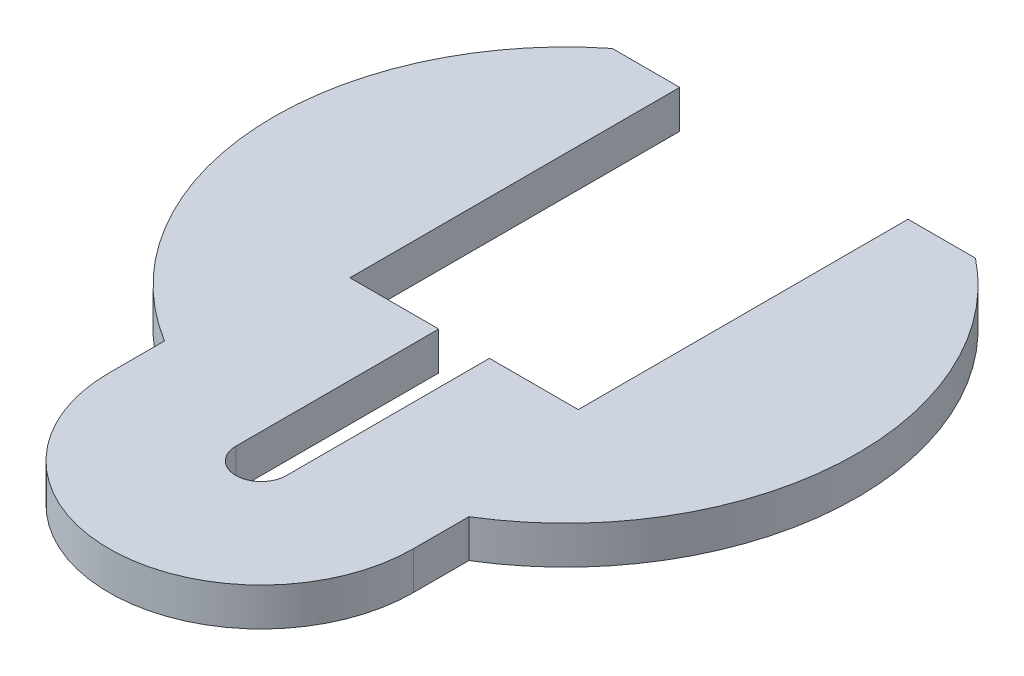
ISO-10303-21;
HEADER;
FILE_DESCRIPTION(('STEP AP214'),'2;1');
FILE_NAME('part.step','',(''),(''),'','','');
FILE_SCHEMA(('AUTOMOTIVE_DESIGN { 1 0 10303 214 1 1 1 1 }'));
ENDSEC;
DATA;
#1=APPLICATION_CONTEXT('core data for automotive mechanical design processes');
#2=APPLICATION_PROTOCOL_DEFINITION('international standard','automotive_design',2000,#1);
#3=PRODUCT_CONTEXT('',#1,'mechanical');
#4=PRODUCT('Part','Part','',(#3));
#5=PRODUCT_RELATED_PRODUCT_CATEGORY('part','',(#4));
#6=PRODUCT_DEFINITION_FORMATION('','',#4);
#7=PRODUCT_DEFINITION_CONTEXT('part definition',#1,'design');
#8=PRODUCT_DEFINITION('design','',#6,#7);
#9=PRODUCT_DEFINITION_SHAPE('','',#8);
#10=(LENGTH_UNIT() NAMED_UNIT(*) SI_UNIT(.MILLI.,.METRE.));
#11=(NAMED_UNIT(*) PLANE_ANGLE_UNIT() SI_UNIT($,.RADIAN.));
#12=(NAMED_UNIT(*) SI_UNIT($,.STERADIAN.) SOLID_ANGLE_UNIT());
#13=UNCERTAINTY_MEASURE_WITH_UNIT(LENGTH_MEASURE(1.E-05),#10,'distance_accuracy_value','');
#14=(GEOMETRIC_REPRESENTATION_CONTEXT(3) GLOBAL_UNCERTAINTY_ASSIGNED_CONTEXT((#13)) GLOBAL_UNIT_ASSIGNED_CONTEXT((#10,
#11,#12)) REPRESENTATION_CONTEXT('',''));
#15=CARTESIAN_POINT('',(0.,0.,0.));
#16=DIRECTION('',(0.,0.,1.));
#17=DIRECTION('',(1.,0.,0.));
#18=AXIS2_PLACEMENT_3D('',#15,#16,#17);
#19=CARTESIAN_POINT('',(0.,3.,0.));
#20=DIRECTION('',(0.,-1.,0.));
#21=DIRECTION('',(0.,0.,-1.));
#22=AXIS2_PLACEMENT_3D('',#19,#20,#21);
#23=CYLINDRICAL_SURFACE('',#22,2.);
#24=CARTESIAN_POINT('',(0.,0.,0.));
#25=DIRECTION('',(0.,-1.,0.));
#26=DIRECTION('',(0.,0.,1.));
#27=AXIS2_PLACEMENT_3D('',#24,#25,#26);
#28=CIRCLE('',#27,2.);
#29=CARTESIAN_POINT('',(2.,0.,0.));
#30=VERTEX_POINT('',#29);
#31=CARTESIAN_POINT('',(-2.,0.,0.));
#32=VERTEX_POINT('',#31);
#33=EDGE_CURVE('E162',#30,#32,#28,.T.);
#34=ORIENTED_EDGE('',*,*,#33,.T.);
#35=DIRECTION('',(0.,-1.,0.));
#36=VECTOR('',#35,1.);
#37=CARTESIAN_POINT('',(-2.,3.,0.));
#38=LINE('',#37,#36);
#39=CARTESIAN_POINT('',(-2.,3.,0.));
#40=VERTEX_POINT('',#39);
#41=EDGE_CURVE('E11',#40,#32,#38,.T.);
#42=ORIENTED_EDGE('',*,*,#41,.F.);
#43=CARTESIAN_POINT('',(0.,3.,0.));
#44=DIRECTION('',(0.,-1.,0.));
#45=DIRECTION('',(0.,0.,1.));
#46=AXIS2_PLACEMENT_3D('',#43,#44,#45);
#47=CIRCLE('',#46,2.);
#48=CARTESIAN_POINT('',(2.,3.,0.));
#49=VERTEX_POINT('',#48);
#50=EDGE_CURVE('E188',#49,#40,#47,.T.);
#51=ORIENTED_EDGE('',*,*,#50,.F.);
#52=DIRECTION('',(0.,-1.,0.));
#53=VECTOR('',#52,1.);
#54=CARTESIAN_POINT('',(2.,3.,0.));
#55=LINE('',#54,#53);
#56=EDGE_CURVE('E158',#49,#30,#55,.T.);
#57=ORIENTED_EDGE('',*,*,#56,.T.);
#58=EDGE_LOOP('',(#34,#42,#51,#57));
#59=FACE_BOUND('',#58,.T.);
#60=ADVANCED_FACE('F30',(#59),#23,.F.);
#61=CARTESIAN_POINT('',(-2.,3.,0.));
#62=DIRECTION('',(-1.,0.,0.));
#63=DIRECTION('',(0.,0.,1.));
#64=AXIS2_PLACEMENT_3D('',#61,#62,#63);
#65=PLANE('',#64);
#66=DIRECTION('',(0.,0.,-1.));
#67=VECTOR('',#66,1.);
#68=CARTESIAN_POINT('',(-2.,0.,0.));
#69=LINE('',#68,#67);
#70=CARTESIAN_POINT('',(-2.,0.,-16.));
#71=VERTEX_POINT('',#70);
#72=EDGE_CURVE('E165',#32,#71,#69,.T.);
#73=ORIENTED_EDGE('',*,*,#72,.T.);
#74=DIRECTION('',(0.,-1.,0.));
#75=VECTOR('',#74,1.);
#76=CARTESIAN_POINT('',(-2.,3.,-16.));
#77=LINE('',#76,#75);
#78=CARTESIAN_POINT('',(-2.,3.,-16.));
#79=VERTEX_POINT('',#78);
#80=EDGE_CURVE('E38',#79,#71,#77,.T.);
#81=ORIENTED_EDGE('',*,*,#80,.F.);
#82=DIRECTION('',(0.,0.,-1.));
#83=VECTOR('',#82,1.);
#84=CARTESIAN_POINT('',(-2.,3.,0.));
#85=LINE('',#84,#83);
#86=EDGE_CURVE('E107',#40,#79,#85,.T.);
#87=ORIENTED_EDGE('',*,*,#86,.F.);
#88=ORIENTED_EDGE('',*,*,#41,.T.);
#89=EDGE_LOOP('',(#73,#81,#87,#88));
#90=FACE_BOUND('',#89,.T.);
#91=ADVANCED_FACE('F276',(#90),#65,.F.);
#92=CARTESIAN_POINT('',(-2.,3.,-16.));
#93=DIRECTION('',(0.,0.,1.));
#94=DIRECTION('',(1.,0.,0.));
#95=AXIS2_PLACEMENT_3D('',#92,#93,#94);
#96=PLANE('',#95);
#97=DIRECTION('',(-1.,0.,0.));
#98=VECTOR('',#97,1.);
#99=CARTESIAN_POINT('',(-2.,0.,-16.));
#100=LINE('',#99,#98);
#101=CARTESIAN_POINT('',(-9.,0.,-16.));
#102=VERTEX_POINT('',#101);
#103=EDGE_CURVE('E167',#71,#102,#100,.T.);
#104=ORIENTED_EDGE('',*,*,#103,.T.);
#105=DIRECTION('',(0.,-1.,0.));
#106=VECTOR('',#105,1.);
#107=CARTESIAN_POINT('',(-9.,3.,-16.));
#108=LINE('',#107,#106);
#109=CARTESIAN_POINT('',(-9.,3.,-16.));
#110=VERTEX_POINT('',#109);
#111=EDGE_CURVE('E213',#110,#102,#108,.T.);
#112=ORIENTED_EDGE('',*,*,#111,.F.);
#113=DIRECTION('',(-1.,0.,0.));
#114=VECTOR('',#113,1.);
#115=CARTESIAN_POINT('',(-2.,3.,-16.));
#116=LINE('',#115,#114);
#117=EDGE_CURVE('E221',#79,#110,#116,.T.);
#118=ORIENTED_EDGE('',*,*,#117,.F.);
#119=ORIENTED_EDGE('',*,*,#80,.T.);
#120=EDGE_LOOP('',(#104,#112,#118,#119));
#121=FACE_BOUND('',#120,.T.);
#122=ADVANCED_FACE('F219',(#121),#96,.F.);
#123=CARTESIAN_POINT('',(-9.,3.,-16.));
#124=DIRECTION('',(-1.,0.,0.));
#125=DIRECTION('',(0.,0.,1.));
#126=AXIS2_PLACEMENT_3D('',#123,#124,#125);
#127=PLANE('',#126);
#128=DIRECTION('',(0.,0.,-1.));
#129=VECTOR('',#128,1.);
#130=CARTESIAN_POINT('',(-9.,0.,-16.));
#131=LINE('',#130,#129);
#132=CARTESIAN_POINT('',(-9.,0.,-42.));
#133=VERTEX_POINT('',#132);
#134=EDGE_CURVE('E169',#102,#133,#131,.T.);
#135=ORIENTED_EDGE('',*,*,#134,.T.);
#136=DIRECTION('',(0.,-1.,0.));
#137=VECTOR('',#136,1.);
#138=CARTESIAN_POINT('',(-9.,3.,-42.));
#139=LINE('',#138,#137);
#140=CARTESIAN_POINT('',(-9.,3.,-42.));
#141=VERTEX_POINT('',#140);
#142=EDGE_CURVE('E210',#141,#133,#139,.T.);
#143=ORIENTED_EDGE('',*,*,#142,.F.);
#144=DIRECTION('',(0.,0.,-1.));
#145=VECTOR('',#144,1.);
#146=CARTESIAN_POINT('',(-9.,3.,-16.));
#147=LINE('',#146,#145);
#148=EDGE_CURVE('E239',#110,#141,#147,.T.);
#149=ORIENTED_EDGE('',*,*,#148,.F.);
#150=ORIENTED_EDGE('',*,*,#111,.T.);
#151=EDGE_LOOP('',(#135,#143,#149,#150));
#152=FACE_BOUND('',#151,.T.);
#153=ADVANCED_FACE('F230',(#152),#127,.F.);
#154=CARTESIAN_POINT('',(-9.,3.,-42.));
#155=DIRECTION('',(0.,0.,1.));
#156=DIRECTION('',(1.,0.,0.));
#157=AXIS2_PLACEMENT_3D('',#154,#155,#156);
#158=PLANE('',#157);
#159=DIRECTION('',(-1.,0.,0.));
#160=VECTOR('',#159,1.);
#161=CARTESIAN_POINT('',(-9.,0.,-42.));
#162=LINE('',#161,#160);
#163=CARTESIAN_POINT('',(-14.3178210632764,0.,-42.));
#164=VERTEX_POINT('',#163);
#165=EDGE_CURVE('E171',#133,#164,#162,.T.);
#166=ORIENTED_EDGE('',*,*,#165,.T.);
#167=DIRECTION('',(0.,-1.,0.));
#168=VECTOR('',#167,1.);
#169=CARTESIAN_POINT('',(-14.3178210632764,3.,-42.));
#170=LINE('',#169,#168);
#171=CARTESIAN_POINT('',(-14.3178210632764,3.,-42.));
#172=VERTEX_POINT('',#171);
#173=EDGE_CURVE('E207',#172,#164,#170,.T.);
#174=ORIENTED_EDGE('',*,*,#173,.F.);
#175=DIRECTION('',(-1.,0.,0.));
#176=VECTOR('',#175,1.);
#177=CARTESIAN_POINT('',(-9.,3.,-42.));
#178=LINE('',#177,#176);
#179=EDGE_CURVE('E236',#141,#172,#178,.T.);
#180=ORIENTED_EDGE('',*,*,#179,.F.);
#181=ORIENTED_EDGE('',*,*,#142,.T.);
#182=EDGE_LOOP('',(#166,#174,#180,#181));
#183=FACE_BOUND('',#182,.T.);
#184=ADVANCED_FACE('F234',(#183),#158,.F.);
#185=CARTESIAN_POINT('',(0.,3.,-24.));
#186=DIRECTION('',(0.,-1.,0.));
#187=DIRECTION('',(0.,0.,-1.));
#188=AXIS2_PLACEMENT_3D('',#185,#186,#187);
#189=CYLINDRICAL_SURFACE('',#188,23.);
#190=CARTESIAN_POINT('',(0.,0.,-24.));
#191=DIRECTION('',(0.,1.,0.));
#192=DIRECTION('',(0.,0.,-1.));
#193=AXIS2_PLACEMENT_3D('',#190,#191,#192);
#194=CIRCLE('',#193,23.);
#195=CARTESIAN_POINT('',(-12.,0.,-4.37858312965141));
#196=VERTEX_POINT('',#195);
#197=EDGE_CURVE('E173',#164,#196,#194,.T.);
#198=ORIENTED_EDGE('',*,*,#197,.T.);
#199=DIRECTION('',(0.,-1.,0.));
#200=VECTOR('',#199,1.);
#201=CARTESIAN_POINT('',(-12.,3.,-4.37858312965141));
#202=LINE('',#201,#200);
#203=CARTESIAN_POINT('',(-12.,3.,-4.37858312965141));
#204=VERTEX_POINT('',#203);
#205=EDGE_CURVE('E204',#204,#196,#202,.T.);
#206=ORIENTED_EDGE('',*,*,#205,.F.);
#207=CARTESIAN_POINT('',(0.,3.,-24.));
#208=DIRECTION('',(0.,1.,0.));
#209=DIRECTION('',(0.,0.,-1.));
#210=AXIS2_PLACEMENT_3D('',#207,#208,#209);
#211=CIRCLE('',#210,23.);
#212=EDGE_CURVE('E238',#172,#204,#211,.T.);
#213=ORIENTED_EDGE('',*,*,#212,.F.);
#214=ORIENTED_EDGE('',*,*,#173,.T.);
#215=EDGE_LOOP('',(#198,#206,#213,#214));
#216=FACE_BOUND('',#215,.T.);
#217=ADVANCED_FACE('F289',(#216),#189,.T.);
#218=CARTESIAN_POINT('',(-12.,3.,0.));
#219=DIRECTION('',(1.,0.,0.));
#220=DIRECTION('',(0.,0.,-1.));
#221=AXIS2_PLACEMENT_3D('',#218,#219,#220);
#222=PLANE('',#221);
#223=DIRECTION('',(0.,0.,1.));
#224=VECTOR('',#223,1.);
#225=CARTESIAN_POINT('',(-12.,0.,0.));
#226=LINE('',#225,#224);
#227=CARTESIAN_POINT('',(-12.,0.,0.));
#228=VERTEX_POINT('',#227);
#229=EDGE_CURVE('E175',#196,#228,#226,.T.);
#230=ORIENTED_EDGE('',*,*,#229,.T.);
#231=DIRECTION('',(0.,-1.,0.));
#232=VECTOR('',#231,1.);
#233=CARTESIAN_POINT('',(-12.,3.,0.));
#234=LINE('',#233,#232);
#235=CARTESIAN_POINT('',(-12.,3.,0.));
#236=VERTEX_POINT('',#235);
#237=EDGE_CURVE('E201',#236,#228,#234,.T.);
#238=ORIENTED_EDGE('',*,*,#237,.F.);
#239=DIRECTION('',(0.,0.,1.));
#240=VECTOR('',#239,1.);
#241=CARTESIAN_POINT('',(-12.,3.,0.));
#242=LINE('',#241,#240);
#243=EDGE_CURVE('E241',#204,#236,#242,.T.);
#244=ORIENTED_EDGE('',*,*,#243,.F.);
#245=ORIENTED_EDGE('',*,*,#205,.T.);
#246=EDGE_LOOP('',(#230,#238,#244,#245));
#247=FACE_BOUND('',#246,.T.);
#248=ADVANCED_FACE('F292',(#247),#222,.F.);
#249=CARTESIAN_POINT('',(0.,3.,0.));
#250=DIRECTION('',(0.,-1.,0.));
#251=DIRECTION('',(0.,0.,-1.));
#252=AXIS2_PLACEMENT_3D('',#249,#250,#251);
#253=CYLINDRICAL_SURFACE('',#252,12.);
#254=CARTESIAN_POINT('',(0.,0.,0.));
#255=DIRECTION('',(0.,1.,0.));
#256=DIRECTION('',(0.,0.,1.));
#257=AXIS2_PLACEMENT_3D('',#254,#255,#256);
#258=CIRCLE('',#257,12.);
#259=CARTESIAN_POINT('',(12.,0.,0.));
#260=VERTEX_POINT('',#259);
#261=EDGE_CURVE('E177',#228,#260,#258,.T.);
#262=ORIENTED_EDGE('',*,*,#261,.T.);
#263=DIRECTION('',(0.,-1.,0.));
#264=VECTOR('',#263,1.);
#265=CARTESIAN_POINT('',(12.,3.,0.));
#266=LINE('',#265,#264);
#267=CARTESIAN_POINT('',(12.,3.,0.));
#268=VERTEX_POINT('',#267);
#269=EDGE_CURVE('E198',#268,#260,#266,.T.);
#270=ORIENTED_EDGE('',*,*,#269,.F.);
#271=CARTESIAN_POINT('',(0.,3.,0.));
#272=DIRECTION('',(0.,1.,0.));
#273=DIRECTION('',(0.,0.,1.));
#274=AXIS2_PLACEMENT_3D('',#271,#272,#273);
#275=CIRCLE('',#274,12.);
#276=EDGE_CURVE('E247',#236,#268,#275,.T.);
#277=ORIENTED_EDGE('',*,*,#276,.F.);
#278=ORIENTED_EDGE('',*,*,#237,.T.);
#279=EDGE_LOOP('',(#262,#270,#277,#278));
#280=FACE_BOUND('',#279,.T.);
#281=ADVANCED_FACE('F296',(#280),#253,.T.);
#282=CARTESIAN_POINT('',(12.,3.,0.));
#283=DIRECTION('',(-1.,0.,0.));
#284=DIRECTION('',(0.,0.,1.));
#285=AXIS2_PLACEMENT_3D('',#282,#283,#284);
#286=PLANE('',#285);
#287=DIRECTION('',(0.,0.,-1.));
#288=VECTOR('',#287,1.);
#289=CARTESIAN_POINT('',(12.,0.,0.));
#290=LINE('',#289,#288);
#291=CARTESIAN_POINT('',(12.,0.,-4.37858312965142));
#292=VERTEX_POINT('',#291);
#293=EDGE_CURVE('E179',#260,#292,#290,.T.);
#294=ORIENTED_EDGE('',*,*,#293,.T.);
#295=DIRECTION('',(0.,-1.,0.));
#296=VECTOR('',#295,1.);
#297=CARTESIAN_POINT('',(12.,3.,-4.37858312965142));
#298=LINE('',#297,#296);
#299=CARTESIAN_POINT('',(12.,3.,-4.37858312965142));
#300=VERTEX_POINT('',#299);
#301=EDGE_CURVE('E195',#300,#292,#298,.T.);
#302=ORIENTED_EDGE('',*,*,#301,.F.);
#303=DIRECTION('',(0.,0.,-1.));
#304=VECTOR('',#303,1.);
#305=CARTESIAN_POINT('',(12.,3.,0.));
#306=LINE('',#305,#304);
#307=EDGE_CURVE('E249',#268,#300,#306,.T.);
#308=ORIENTED_EDGE('',*,*,#307,.F.);
#309=ORIENTED_EDGE('',*,*,#269,.T.);
#310=EDGE_LOOP('',(#294,#302,#308,#309));
#311=FACE_BOUND('',#310,.T.);
#312=ADVANCED_FACE('F300',(#311),#286,.F.);
#313=CARTESIAN_POINT('',(0.,3.,-24.));
#314=DIRECTION('',(0.,-1.,0.));
#315=DIRECTION('',(0.,0.,-1.));
#316=AXIS2_PLACEMENT_3D('',#313,#314,#315);
#317=CYLINDRICAL_SURFACE('',#316,23.);
#318=CARTESIAN_POINT('',(0.,0.,-24.));
#319=DIRECTION('',(0.,1.,0.));
#320=DIRECTION('',(0.,0.,1.));
#321=AXIS2_PLACEMENT_3D('',#318,#319,#320);
#322=CIRCLE('',#321,23.);
#323=CARTESIAN_POINT('',(14.3178210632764,0.,-42.));
#324=VERTEX_POINT('',#323);
#325=EDGE_CURVE('E181',#292,#324,#322,.T.);
#326=ORIENTED_EDGE('',*,*,#325,.T.);
#327=DIRECTION('',(0.,-1.,0.));
#328=VECTOR('',#327,1.);
#329=CARTESIAN_POINT('',(14.3178210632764,3.,-42.));
#330=LINE('',#329,#328);
#331=CARTESIAN_POINT('',(14.3178210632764,3.,-42.));
#332=VERTEX_POINT('',#331);
#333=EDGE_CURVE('E192',#332,#324,#330,.T.);
#334=ORIENTED_EDGE('',*,*,#333,.F.);
#335=CARTESIAN_POINT('',(0.,3.,-24.));
#336=DIRECTION('',(0.,1.,0.));
#337=DIRECTION('',(0.,0.,1.));
#338=AXIS2_PLACEMENT_3D('',#335,#336,#337);
#339=CIRCLE('',#338,23.);
#340=EDGE_CURVE('E251',#300,#332,#339,.T.);
#341=ORIENTED_EDGE('',*,*,#340,.F.);
#342=ORIENTED_EDGE('',*,*,#301,.T.);
#343=EDGE_LOOP('',(#326,#334,#341,#342));
#344=FACE_BOUND('',#343,.T.);
#345=ADVANCED_FACE('F257',(#344),#317,.T.);
#346=CARTESIAN_POINT('',(9.,3.,-42.));
#347=DIRECTION('',(0.,0.,1.));
#348=DIRECTION('',(1.,0.,0.));
#349=AXIS2_PLACEMENT_3D('',#346,#347,#348);
#350=PLANE('',#349);
#351=DIRECTION('',(-1.,0.,0.));
#352=VECTOR('',#351,1.);
#353=CARTESIAN_POINT('',(9.,0.,-42.));
#354=LINE('',#353,#352);
#355=CARTESIAN_POINT('',(9.,0.,-42.));
#356=VERTEX_POINT('',#355);
#357=EDGE_CURVE('E183',#324,#356,#354,.T.);
#358=ORIENTED_EDGE('',*,*,#357,.T.);
#359=DIRECTION('',(0.,-1.,0.));
#360=VECTOR('',#359,1.);
#361=CARTESIAN_POINT('',(9.,3.,-42.));
#362=LINE('',#361,#360);
#363=CARTESIAN_POINT('',(9.,3.,-42.));
#364=VERTEX_POINT('',#363);
#365=EDGE_CURVE('E153',#364,#356,#362,.T.);
#366=ORIENTED_EDGE('',*,*,#365,.F.);
#367=DIRECTION('',(-1.,0.,0.));
#368=VECTOR('',#367,1.);
#369=CARTESIAN_POINT('',(9.,3.,-42.));
#370=LINE('',#369,#368);
#371=EDGE_CURVE('E144',#332,#364,#370,.T.);
#372=ORIENTED_EDGE('',*,*,#371,.F.);
#373=ORIENTED_EDGE('',*,*,#333,.T.);
#374=EDGE_LOOP('',(#358,#366,#372,#373));
#375=FACE_BOUND('',#374,.T.);
#376=ADVANCED_FACE('F261',(#375),#350,.F.);
#377=CARTESIAN_POINT('',(9.,3.,-16.));
#378=DIRECTION('',(1.,0.,0.));
#379=DIRECTION('',(0.,0.,-1.));
#380=AXIS2_PLACEMENT_3D('',#377,#378,#379);
#381=PLANE('',#380);
#382=DIRECTION('',(0.,0.,1.));
#383=VECTOR('',#382,1.);
#384=CARTESIAN_POINT('',(9.,0.,-16.));
#385=LINE('',#384,#383);
#386=CARTESIAN_POINT('',(9.,0.,-16.));
#387=VERTEX_POINT('',#386);
#388=EDGE_CURVE('E152',#356,#387,#385,.T.);
#389=ORIENTED_EDGE('',*,*,#388,.T.);
#390=DIRECTION('',(0.,-1.,0.));
#391=VECTOR('',#390,1.);
#392=CARTESIAN_POINT('',(9.,3.,-16.));
#393=LINE('',#392,#391);
#394=CARTESIAN_POINT('',(9.,3.,-16.));
#395=VERTEX_POINT('',#394);
#396=EDGE_CURVE('E149',#395,#387,#393,.T.);
#397=ORIENTED_EDGE('',*,*,#396,.F.);
#398=DIRECTION('',(0.,0.,1.));
#399=VECTOR('',#398,1.);
#400=CARTESIAN_POINT('',(9.,3.,-16.));
#401=LINE('',#400,#399);
#402=EDGE_CURVE('E138',#364,#395,#401,.T.);
#403=ORIENTED_EDGE('',*,*,#402,.F.);
#404=ORIENTED_EDGE('',*,*,#365,.T.);
#405=EDGE_LOOP('',(#389,#397,#403,#404));
#406=FACE_BOUND('',#405,.T.);
#407=ADVANCED_FACE('F150',(#406),#381,.F.);
#408=CARTESIAN_POINT('',(2.,3.,-16.));
#409=DIRECTION('',(0.,0.,1.));
#410=DIRECTION('',(1.,0.,0.));
#411=AXIS2_PLACEMENT_3D('',#408,#409,#410);
#412=PLANE('',#411);
#413=DIRECTION('',(-1.,0.,0.));
#414=VECTOR('',#413,1.);
#415=CARTESIAN_POINT('',(2.,0.,-16.));
#416=LINE('',#415,#414);
#417=CARTESIAN_POINT('',(2.,0.,-16.));
#418=VERTEX_POINT('',#417);
#419=EDGE_CURVE('E93',#387,#418,#416,.T.);
#420=ORIENTED_EDGE('',*,*,#419,.T.);
#421=DIRECTION('',(0.,-1.,0.));
#422=VECTOR('',#421,1.);
#423=CARTESIAN_POINT('',(2.,3.,-16.));
#424=LINE('',#423,#422);
#425=CARTESIAN_POINT('',(2.,3.,-16.));
#426=VERTEX_POINT('',#425);
#427=EDGE_CURVE('E154',#426,#418,#424,.T.);
#428=ORIENTED_EDGE('',*,*,#427,.F.);
#429=DIRECTION('',(-1.,0.,0.));
#430=VECTOR('',#429,1.);
#431=CARTESIAN_POINT('',(2.,3.,-16.));
#432=LINE('',#431,#430);
#433=EDGE_CURVE('E142',#395,#426,#432,.T.);
#434=ORIENTED_EDGE('',*,*,#433,.F.);
#435=ORIENTED_EDGE('',*,*,#396,.T.);
#436=EDGE_LOOP('',(#420,#428,#434,#435));
#437=FACE_BOUND('',#436,.T.);
#438=ADVANCED_FACE('F156',(#437),#412,.F.);
#439=CARTESIAN_POINT('',(2.,3.,0.));
#440=DIRECTION('',(1.,0.,0.));
#441=DIRECTION('',(0.,0.,-1.));
#442=AXIS2_PLACEMENT_3D('',#439,#440,#441);
#443=PLANE('',#442);
#444=DIRECTION('',(0.,0.,1.));
#445=VECTOR('',#444,1.);
#446=CARTESIAN_POINT('',(2.,0.,0.));
#447=LINE('',#446,#445);
#448=EDGE_CURVE('E99',#418,#30,#447,.T.);
#449=ORIENTED_EDGE('',*,*,#448,.T.);
#450=ORIENTED_EDGE('',*,*,#56,.F.);
#451=DIRECTION('',(0.,0.,1.));
#452=VECTOR('',#451,1.);
#453=CARTESIAN_POINT('',(2.,3.,0.));
#454=LINE('',#453,#452);
#455=EDGE_CURVE('E46',#426,#49,#454,.T.);
#456=ORIENTED_EDGE('',*,*,#455,.F.);
#457=ORIENTED_EDGE('',*,*,#427,.T.);
#458=EDGE_LOOP('',(#449,#450,#456,#457));
#459=FACE_BOUND('',#458,.T.);
#460=ADVANCED_FACE('F265',(#459),#443,.F.);
#461=CARTESIAN_POINT('',(0.,3.,0.));
#462=DIRECTION('',(0.,1.,0.));
#463=DIRECTION('',(0.,0.,1.));
#464=AXIS2_PLACEMENT_3D('',#461,#462,#463);
#465=PLANE('',#464);
#466=ORIENTED_EDGE('',*,*,#50,.T.);
#467=ORIENTED_EDGE('',*,*,#86,.T.);
#468=ORIENTED_EDGE('',*,*,#117,.T.);
#469=ORIENTED_EDGE('',*,*,#148,.T.);
#470=ORIENTED_EDGE('',*,*,#179,.T.);
#471=ORIENTED_EDGE('',*,*,#212,.T.);
#472=ORIENTED_EDGE('',*,*,#243,.T.);
#473=ORIENTED_EDGE('',*,*,#276,.T.);
#474=ORIENTED_EDGE('',*,*,#307,.T.);
#475=ORIENTED_EDGE('',*,*,#340,.T.);
#476=ORIENTED_EDGE('',*,*,#371,.T.);
#477=ORIENTED_EDGE('',*,*,#402,.T.);
#478=ORIENTED_EDGE('',*,*,#433,.T.);
#479=ORIENTED_EDGE('',*,*,#455,.T.);
#480=EDGE_LOOP('',(#466,#467,#468,#469,#470,#471,#472,#473,#474,#475,#476,#477,#478,#479));
#481=FACE_BOUND('',#480,.T.);
#482=ADVANCED_FACE('F140',(#481),#465,.T.);
#483=CARTESIAN_POINT('',(0.,0.,0.));
#484=DIRECTION('',(0.,1.,0.));
#485=DIRECTION('',(0.,0.,1.));
#486=AXIS2_PLACEMENT_3D('',#483,#484,#485);
#487=PLANE('',#486);
#488=ORIENTED_EDGE('',*,*,#33,.F.);
#489=ORIENTED_EDGE('',*,*,#448,.F.);
#490=ORIENTED_EDGE('',*,*,#419,.F.);
#491=ORIENTED_EDGE('',*,*,#388,.F.);
#492=ORIENTED_EDGE('',*,*,#357,.F.);
#493=ORIENTED_EDGE('',*,*,#325,.F.);
#494=ORIENTED_EDGE('',*,*,#293,.F.);
#495=ORIENTED_EDGE('',*,*,#261,.F.);
#496=ORIENTED_EDGE('',*,*,#229,.F.);
#497=ORIENTED_EDGE('',*,*,#197,.F.);
#498=ORIENTED_EDGE('',*,*,#165,.F.);
#499=ORIENTED_EDGE('',*,*,#134,.F.);
#500=ORIENTED_EDGE('',*,*,#103,.F.);
#501=ORIENTED_EDGE('',*,*,#72,.F.);
#502=EDGE_LOOP('',(#488,#489,#490,#491,#492,#493,#494,#495,#496,#497,#498,#499,#500,#501));
#503=FACE_BOUND('',#502,.T.);
#504=ADVANCED_FACE('F225',(#503),#487,.F.);
#505=CLOSED_SHELL('',(#60,#91,#122,#153,#184,#217,#248,#281,#312,#345,#376,#407,#438,#460,#482,#504));
#506=MANIFOLD_SOLID_BREP('B2',#505);
#507=ADVANCED_BREP_SHAPE_REPRESENTATION('',(#18,#506),#14);
#508=SHAPE_DEFINITION_REPRESENTATION(#9,#507);
ENDSEC;
END-ISO-10303-21;
